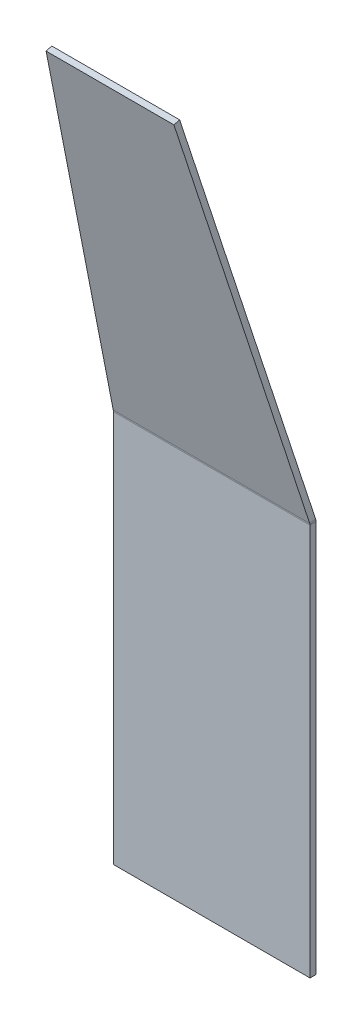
ISO-10303-21;
HEADER;
FILE_DESCRIPTION(('STEP AP214'),'2;1');
FILE_NAME('part.step','',(''),(''),'','','');
FILE_SCHEMA(('AUTOMOTIVE_DESIGN { 1 0 10303 214 1 1 1 1 }'));
ENDSEC;
DATA;
#1=APPLICATION_CONTEXT('core data for automotive mechanical design processes');
#2=APPLICATION_PROTOCOL_DEFINITION('international standard','automotive_design',2000,#1);
#3=PRODUCT_CONTEXT('',#1,'mechanical');
#4=PRODUCT('Part','Part','',(#3));
#5=PRODUCT_RELATED_PRODUCT_CATEGORY('part','',(#4));
#6=PRODUCT_DEFINITION_FORMATION('','',#4);
#7=PRODUCT_DEFINITION_CONTEXT('part definition',#1,'design');
#8=PRODUCT_DEFINITION('design','',#6,#7);
#9=PRODUCT_DEFINITION_SHAPE('','',#8);
#10=(LENGTH_UNIT() NAMED_UNIT(*) SI_UNIT(.MILLI.,.METRE.));
#11=(NAMED_UNIT(*) PLANE_ANGLE_UNIT() SI_UNIT($,.RADIAN.));
#12=(NAMED_UNIT(*) SI_UNIT($,.STERADIAN.) SOLID_ANGLE_UNIT());
#13=UNCERTAINTY_MEASURE_WITH_UNIT(LENGTH_MEASURE(1.E-05),#10,'distance_accuracy_value','');
#14=(GEOMETRIC_REPRESENTATION_CONTEXT(3) GLOBAL_UNCERTAINTY_ASSIGNED_CONTEXT((#13)) GLOBAL_UNIT_ASSIGNED_CONTEXT((#10,
#11,#12)) REPRESENTATION_CONTEXT('',''));
#15=CARTESIAN_POINT('',(0.,0.,0.));
#16=DIRECTION('',(0.,0.,1.));
#17=DIRECTION('',(1.,0.,0.));
#18=AXIS2_PLACEMENT_3D('',#15,#16,#17);
#19=CARTESIAN_POINT('',(0.,196.401798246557,27.3567872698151));
#20=DIRECTION('',(0.,0.258819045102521,-0.965925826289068));
#21=DIRECTION('',(-1.,0.,0.));
#22=AXIS2_PLACEMENT_3D('',#19,#20,#21);
#23=PLANE('',#22);
#24=DIRECTION('',(-0.0871557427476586,-0.962250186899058,-0.2578341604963));
#25=VECTOR('',#24,1.);
#26=CARTESIAN_POINT('',(0.,99.8092156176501,1.47488275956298));
#27=LINE('',#26,#25);
#28=CARTESIAN_POINT('',(8.74886635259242,196.401798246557,27.3567872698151));
#29=VERTEX_POINT('',#28);
#30=CARTESIAN_POINT('',(0.0257675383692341,100.093704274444,1.5511111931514));
#31=VERTEX_POINT('',#30);
#32=EDGE_CURVE('E112',#29,#31,#27,.T.);
#33=ORIENTED_EDGE('',*,*,#32,.T.);
#34=DIRECTION('',(1.,0.,0.));
#35=VECTOR('',#34,1.);
#36=CARTESIAN_POINT('',(0.,100.09370425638,1.5511112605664));
#37=LINE('',#36,#35);
#38=CARTESIAN_POINT('',(49.9742324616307,100.09370425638,1.5511112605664));
#39=VERTEX_POINT('',#38);
#40=EDGE_CURVE('E152',#31,#39,#37,.T.);
#41=ORIENTED_EDGE('',*,*,#40,.T.);
#42=DIRECTION('',(-0.0871557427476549,0.962250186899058,0.2578341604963));
#43=VECTOR('',#42,1.);
#44=CARTESIAN_POINT('',(41.2511336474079,196.401798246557,27.3567872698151));
#45=LINE('',#44,#43);
#46=CARTESIAN_POINT('',(41.2511336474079,196.401798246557,27.3567872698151));
#47=VERTEX_POINT('',#46);
#48=EDGE_CURVE('E116',#39,#47,#45,.T.);
#49=ORIENTED_EDGE('',*,*,#48,.T.);
#50=DIRECTION('',(-1.,0.,0.));
#51=VECTOR('',#50,1.);
#52=CARTESIAN_POINT('',(8.74886635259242,196.401798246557,27.3567872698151));
#53=LINE('',#52,#51);
#54=EDGE_CURVE('E80',#47,#29,#53,.T.);
#55=ORIENTED_EDGE('',*,*,#54,.T.);
#56=EDGE_LOOP('',(#33,#41,#49,#55));
#57=FACE_BOUND('',#56,.T.);
#58=ADVANCED_FACE('F52',(#57),#23,.F.);
#59=CARTESIAN_POINT('',(0.,99.8092156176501,1.47488275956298));
#60=DIRECTION('',(0.996194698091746,-0.0841859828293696,-0.02255756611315));
#61=DIRECTION('',(0.0871557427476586,0.962250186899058,0.2578341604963));
#62=AXIS2_PLACEMENT_3D('',#59,#60,#61);
#63=PLANE('',#62);
#64=DIRECTION('',(-0.0871557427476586,-0.962250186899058,-0.2578341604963));
#65=VECTOR('',#64,1.);
#66=CARTESIAN_POINT('',(0.,100.197444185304,0.0259940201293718));
#67=LINE('',#66,#65);
#68=CARTESIAN_POINT('',(8.74886635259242,196.790026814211,25.9078985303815));
#69=VERTEX_POINT('',#68);
#70=CARTESIAN_POINT('',(0.0257675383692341,100.481932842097,0.102222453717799));
#71=VERTEX_POINT('',#70);
#72=EDGE_CURVE('E103',#69,#71,#67,.T.);
#73=ORIENTED_EDGE('',*,*,#72,.T.);
#74=CARTESIAN_POINT('',(0.0257675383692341,100.093704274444,1.5511111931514));
#75=CARTESIAN_POINT('',(0.0257675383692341,100.481932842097,0.1022224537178));
#76=B_SPLINE_CURVE_WITH_KNOTS('',1,(#74,#75),.UNSPECIFIED.,.F.,.F.,(2,2),(0.,1.),.UNSPECIFIED.);
#77=EDGE_CURVE('E128',#71,#31,#76,.F.);
#78=ORIENTED_EDGE('',*,*,#77,.T.);
#79=ORIENTED_EDGE('',*,*,#32,.F.);
#80=DIRECTION('',(0.,0.258819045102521,-0.965925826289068));
#81=VECTOR('',#80,1.);
#82=CARTESIAN_POINT('',(8.74886635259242,196.401798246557,27.3567872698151));
#83=LINE('',#82,#81);
#84=EDGE_CURVE('E96',#29,#69,#83,.T.);
#85=ORIENTED_EDGE('',*,*,#84,.T.);
#86=EDGE_LOOP('',(#73,#78,#79,#85));
#87=FACE_BOUND('',#86,.T.);
#88=ADVANCED_FACE('F108',(#87),#63,.F.);
#89=CARTESIAN_POINT('',(41.2511336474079,196.401798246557,27.3567872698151));
#90=DIRECTION('',(-0.996194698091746,-0.084185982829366,-0.022557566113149));
#91=DIRECTION('',(0.0871557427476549,-0.962250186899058,-0.2578341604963));
#92=AXIS2_PLACEMENT_3D('',#89,#90,#91);
#93=PLANE('',#92);
#94=ORIENTED_EDGE('',*,*,#48,.F.);
#95=CARTESIAN_POINT('',(49.9742324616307,100.481932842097,0.1022224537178));
#96=CARTESIAN_POINT('',(49.9742324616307,100.093704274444,1.5511111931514));
#97=B_SPLINE_CURVE_WITH_KNOTS('',1,(#95,#96),.UNSPECIFIED.,.F.,.F.,(2,2),(0.,1.),.UNSPECIFIED.);
#98=CARTESIAN_POINT('',(49.9742324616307,100.481932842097,0.102222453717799));
#99=VERTEX_POINT('',#98);
#100=EDGE_CURVE('E12',#39,#99,#97,.F.);
#101=ORIENTED_EDGE('',*,*,#100,.T.);
#102=DIRECTION('',(-0.0871557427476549,0.962250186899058,0.2578341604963));
#103=VECTOR('',#102,1.);
#104=CARTESIAN_POINT('',(41.2511336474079,196.790026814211,25.9078985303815));
#105=LINE('',#104,#103);
#106=CARTESIAN_POINT('',(41.2511336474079,196.790026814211,25.9078985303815));
#107=VERTEX_POINT('',#106);
#108=EDGE_CURVE('E104',#99,#107,#105,.T.);
#109=ORIENTED_EDGE('',*,*,#108,.T.);
#110=DIRECTION('',(0.,0.258819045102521,-0.965925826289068));
#111=VECTOR('',#110,1.);
#112=CARTESIAN_POINT('',(41.2511336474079,196.401798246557,27.3567872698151));
#113=LINE('',#112,#111);
#114=EDGE_CURVE('E99',#47,#107,#113,.T.);
#115=ORIENTED_EDGE('',*,*,#114,.F.);
#116=EDGE_LOOP('',(#94,#101,#109,#115));
#117=FACE_BOUND('',#116,.T.);
#118=ADVANCED_FACE('F54',(#117),#93,.F.);
#119=CARTESIAN_POINT('',(8.74886635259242,196.401798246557,27.3567872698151));
#120=DIRECTION('',(0.,-0.965925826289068,-0.258819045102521));
#121=DIRECTION('',(0.,0.258819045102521,-0.965925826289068));
#122=AXIS2_PLACEMENT_3D('',#119,#120,#121);
#123=PLANE('',#122);
#124=DIRECTION('',(-1.,0.,0.));
#125=VECTOR('',#124,1.);
#126=CARTESIAN_POINT('',(8.74886635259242,196.790026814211,25.9078985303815));
#127=LINE('',#126,#125);
#128=EDGE_CURVE('E93',#107,#69,#127,.T.);
#129=ORIENTED_EDGE('',*,*,#128,.T.);
#130=ORIENTED_EDGE('',*,*,#84,.F.);
#131=ORIENTED_EDGE('',*,*,#54,.F.);
#132=ORIENTED_EDGE('',*,*,#114,.T.);
#133=EDGE_LOOP('',(#129,#130,#131,#132));
#134=FACE_BOUND('',#133,.T.);
#135=ADVANCED_FACE('F95',(#134),#123,.F.);
#136=CARTESIAN_POINT('',(0.,196.790026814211,25.9078985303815));
#137=DIRECTION('',(0.,0.258819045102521,-0.965925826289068));
#138=DIRECTION('',(-1.,0.,0.));
#139=AXIS2_PLACEMENT_3D('',#136,#137,#138);
#140=PLANE('',#139);
#141=DIRECTION('',(1.,0.,0.));
#142=VECTOR('',#141,1.);
#143=CARTESIAN_POINT('',(0.,100.481932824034,0.102222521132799));
#144=LINE('',#143,#142);
#145=EDGE_CURVE('E63',#71,#99,#144,.T.);
#146=ORIENTED_EDGE('',*,*,#145,.F.);
#147=ORIENTED_EDGE('',*,*,#72,.F.);
#148=ORIENTED_EDGE('',*,*,#128,.F.);
#149=ORIENTED_EDGE('',*,*,#108,.F.);
#150=EDGE_LOOP('',(#146,#147,#148,#149));
#151=FACE_BOUND('',#150,.T.);
#152=ADVANCED_FACE('F114',(#151),#140,.T.);
#153=CARTESIAN_POINT('',(0.,0.,1.5));
#154=DIRECTION('',(0.,1.,0.));
#155=DIRECTION('',(0.,0.,1.));
#156=AXIS2_PLACEMENT_3D('',#153,#154,#155);
#157=PLANE('',#156);
#158=DIRECTION('',(1.,0.,0.));
#159=VECTOR('',#158,1.);
#160=CARTESIAN_POINT('',(0.,0.,0.));
#161=LINE('',#160,#159);
#162=CARTESIAN_POINT('',(0.,0.,0.));
#163=VERTEX_POINT('',#162);
#164=CARTESIAN_POINT('',(50.,0.,0.));
#165=VERTEX_POINT('',#164);
#166=EDGE_CURVE('E296',#163,#165,#161,.T.);
#167=ORIENTED_EDGE('',*,*,#166,.T.);
#168=DIRECTION('',(0.,0.,-1.));
#169=VECTOR('',#168,1.);
#170=CARTESIAN_POINT('',(50.,0.,1.5));
#171=LINE('',#170,#169);
#172=CARTESIAN_POINT('',(50.,0.,1.5));
#173=VERTEX_POINT('',#172);
#174=EDGE_CURVE('E317',#173,#165,#171,.T.);
#175=ORIENTED_EDGE('',*,*,#174,.F.);
#176=DIRECTION('',(1.,0.,0.));
#177=VECTOR('',#176,1.);
#178=CARTESIAN_POINT('',(0.,0.,1.5));
#179=LINE('',#178,#177);
#180=CARTESIAN_POINT('',(0.,0.,1.5));
#181=VERTEX_POINT('',#180);
#182=EDGE_CURVE('E305',#181,#173,#179,.T.);
#183=ORIENTED_EDGE('',*,*,#182,.F.);
#184=DIRECTION('',(0.,0.,-1.));
#185=VECTOR('',#184,1.);
#186=CARTESIAN_POINT('',(0.,0.,1.5));
#187=LINE('',#186,#185);
#188=EDGE_CURVE('E299',#181,#163,#187,.T.);
#189=ORIENTED_EDGE('',*,*,#188,.T.);
#190=EDGE_LOOP('',(#167,#175,#183,#189));
#191=FACE_BOUND('',#190,.T.);
#192=ADVANCED_FACE('F337',(#191),#157,.F.);
#193=CARTESIAN_POINT('',(0.,200.,1.5));
#194=DIRECTION('',(0.,0.,-1.));
#195=DIRECTION('',(-1.,0.,0.));
#196=AXIS2_PLACEMENT_3D('',#193,#194,#195);
#197=PLANE('',#196);
#198=DIRECTION('',(1.,0.,0.));
#199=VECTOR('',#198,1.);
#200=CARTESIAN_POINT('',(0.,99.705475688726,1.5));
#201=LINE('',#200,#199);
#202=CARTESIAN_POINT('',(1.10630273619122E-13,99.705475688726,1.49999993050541));
#203=VERTEX_POINT('',#202);
#204=CARTESIAN_POINT('',(50.,99.705475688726,1.5));
#205=VERTEX_POINT('',#204);
#206=EDGE_CURVE('E283',#203,#205,#201,.T.);
#207=ORIENTED_EDGE('',*,*,#206,.F.);
#208=DIRECTION('',(0.,-1.,0.));
#209=VECTOR('',#208,1.);
#210=CARTESIAN_POINT('',(0.,0.,1.5));
#211=LINE('',#210,#209);
#212=EDGE_CURVE('E302',#203,#181,#211,.T.);
#213=ORIENTED_EDGE('',*,*,#212,.T.);
#214=ORIENTED_EDGE('',*,*,#182,.T.);
#215=DIRECTION('',(0.,1.,0.));
#216=VECTOR('',#215,1.);
#217=CARTESIAN_POINT('',(50.,0.,1.5));
#218=LINE('',#217,#216);
#219=EDGE_CURVE('E308',#173,#205,#218,.T.);
#220=ORIENTED_EDGE('',*,*,#219,.T.);
#221=EDGE_LOOP('',(#207,#213,#214,#220));
#222=FACE_BOUND('',#221,.T.);
#223=ADVANCED_FACE('F386',(#222),#197,.F.);
#224=CARTESIAN_POINT('',(0.,0.,1.5));
#225=DIRECTION('',(1.,0.,0.));
#226=DIRECTION('',(0.,1.,0.));
#227=AXIS2_PLACEMENT_3D('',#224,#225,#226);
#228=PLANE('',#227);
#229=DIRECTION('',(0.,0.,1.));
#230=VECTOR('',#229,1.);
#231=CARTESIAN_POINT('',(0.,99.705475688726,1.5000000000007));
#232=LINE('',#231,#230);
#233=CARTESIAN_POINT('',(0.,99.705475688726,0.));
#234=VERTEX_POINT('',#233);
#235=EDGE_CURVE('E290',#234,#203,#232,.T.);
#236=ORIENTED_EDGE('',*,*,#235,.F.);
#237=DIRECTION('',(0.,-1.,0.));
#238=VECTOR('',#237,1.);
#239=CARTESIAN_POINT('',(0.,0.,0.));
#240=LINE('',#239,#238);
#241=EDGE_CURVE('E311',#234,#163,#240,.T.);
#242=ORIENTED_EDGE('',*,*,#241,.T.);
#243=ORIENTED_EDGE('',*,*,#188,.F.);
#244=ORIENTED_EDGE('',*,*,#212,.F.);
#245=EDGE_LOOP('',(#236,#242,#243,#244));
#246=FACE_BOUND('',#245,.T.);
#247=ADVANCED_FACE('F401',(#246),#228,.F.);
#248=CARTESIAN_POINT('',(0.,200.,0.));
#249=DIRECTION('',(0.,0.,-1.));
#250=DIRECTION('',(-1.,0.,0.));
#251=AXIS2_PLACEMENT_3D('',#248,#249,#250);
#252=PLANE('',#251);
#253=ORIENTED_EDGE('',*,*,#241,.F.);
#254=DIRECTION('',(1.,0.,0.));
#255=VECTOR('',#254,1.);
#256=CARTESIAN_POINT('',(0.,99.705475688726,0.));
#257=LINE('',#256,#255);
#258=CARTESIAN_POINT('',(50.,99.705475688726,0.));
#259=VERTEX_POINT('',#258);
#260=EDGE_CURVE('E314',#234,#259,#257,.T.);
#261=ORIENTED_EDGE('',*,*,#260,.T.);
#262=DIRECTION('',(0.,1.,0.));
#263=VECTOR('',#262,1.);
#264=CARTESIAN_POINT('',(50.,0.,0.));
#265=LINE('',#264,#263);
#266=EDGE_CURVE('E132',#165,#259,#265,.T.);
#267=ORIENTED_EDGE('',*,*,#266,.F.);
#268=ORIENTED_EDGE('',*,*,#166,.F.);
#269=EDGE_LOOP('',(#253,#261,#267,#268));
#270=FACE_BOUND('',#269,.T.);
#271=ADVANCED_FACE('F395',(#270),#252,.T.);
#272=CARTESIAN_POINT('',(50.,0.,1.5));
#273=DIRECTION('',(-1.,0.,0.));
#274=DIRECTION('',(0.,-1.,0.));
#275=AXIS2_PLACEMENT_3D('',#272,#273,#274);
#276=PLANE('',#275);
#277=DIRECTION('',(0.,0.,-1.));
#278=VECTOR('',#277,1.);
#279=CARTESIAN_POINT('',(50.,99.705475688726,1.5000000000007));
#280=LINE('',#279,#278);
#281=EDGE_CURVE('E286',#205,#259,#280,.T.);
#282=ORIENTED_EDGE('',*,*,#281,.F.);
#283=ORIENTED_EDGE('',*,*,#219,.F.);
#284=ORIENTED_EDGE('',*,*,#174,.T.);
#285=ORIENTED_EDGE('',*,*,#266,.T.);
#286=EDGE_LOOP('',(#282,#283,#284,#285));
#287=FACE_BOUND('',#286,.T.);
#288=ADVANCED_FACE('F390',(#287),#276,.F.);
#289=CARTESIAN_POINT('',(0.,99.705475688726,3.00000006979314));
#290=DIRECTION('',(1.,7.00763223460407E-13,0.));
#291=DIRECTION('',(-7.00763223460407E-13,1.,0.));
#292=AXIS2_PLACEMENT_3D('',#289,#290,#291);
#293=PLANE('',#292);
#294=CARTESIAN_POINT('',(0.,100.097054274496,0.0256653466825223));
#295=CARTESIAN_POINT('',(0.,99.9012649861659,1.51283263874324));
#296=B_SPLINE_CURVE_WITH_KNOTS('',1,(#294,#295),.UNSPECIFIED.,.F.,.F.,(2,2),(0.,1.),.UNSPECIFIED.);
#297=CARTESIAN_POINT('',(0.,100.097054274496,0.025665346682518));
#298=VERTEX_POINT('',#297);
#299=CARTESIAN_POINT('',(0.,99.9012649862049,1.51283263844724));
#300=VERTEX_POINT('',#299);
#301=EDGE_CURVE('E280',#298,#300,#296,.T.);
#302=ORIENTED_EDGE('',*,*,#301,.F.);
#303=CARTESIAN_POINT('',(0.,99.705475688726,3.));
#304=DIRECTION('',(-1.,0.,0.));
#305=DIRECTION('',(0.,0.,1.));
#306=AXIS2_PLACEMENT_3D('',#303,#304,#305);
#307=CIRCLE('',#306,3.00000006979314);
#308=EDGE_CURVE('E189',#298,#234,#307,.T.);
#309=ORIENTED_EDGE('',*,*,#308,.T.);
#310=ORIENTED_EDGE('',*,*,#235,.T.);
#311=CARTESIAN_POINT('',(0.,99.705475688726,3.00000006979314));
#312=DIRECTION('',(-1.,-7.00763223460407E-13,0.));
#313=DIRECTION('',(7.00763223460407E-13,-1.,0.));
#314=AXIS2_PLACEMENT_3D('',#311,#312,#313);
#315=CIRCLE('',#314,1.50000013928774);
#316=EDGE_CURVE('E190',#300,#203,#315,.T.);
#317=ORIENTED_EDGE('',*,*,#316,.F.);
#318=EDGE_LOOP('',(#302,#309,#310,#317));
#319=FACE_BOUND('',#318,.T.);
#320=ADVANCED_FACE('F335',(#319),#293,.F.);
#321=CARTESIAN_POINT('',(50.,99.705475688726,3.00000006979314));
#322=DIRECTION('',(-1.,0.,0.));
#323=DIRECTION('',(0.,0.,1.));
#324=AXIS2_PLACEMENT_3D('',#321,#322,#323);
#325=PLANE('',#324);
#326=ORIENTED_EDGE('',*,*,#281,.T.);
#327=CARTESIAN_POINT('',(50.,99.705475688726,3.));
#328=DIRECTION('',(-1.,0.,0.));
#329=DIRECTION('',(0.,0.,1.));
#330=AXIS2_PLACEMENT_3D('',#327,#328,#329);
#331=CIRCLE('',#330,3.00000006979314);
#332=CARTESIAN_POINT('',(50.,100.097054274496,0.025665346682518));
#333=VERTEX_POINT('',#332);
#334=EDGE_CURVE('E220',#259,#333,#331,.F.);
#335=ORIENTED_EDGE('',*,*,#334,.T.);
#336=CARTESIAN_POINT('',(50.,99.9012649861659,1.51283263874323));
#337=CARTESIAN_POINT('',(50.,100.097054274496,0.0256653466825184));
#338=B_SPLINE_CURVE_WITH_KNOTS('',1,(#336,#337),.UNSPECIFIED.,.F.,.F.,(2,2),(0.,1.),.UNSPECIFIED.);
#339=CARTESIAN_POINT('',(50.,99.9012649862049,1.51283263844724));
#340=VERTEX_POINT('',#339);
#341=EDGE_CURVE('E277',#333,#340,#338,.F.);
#342=ORIENTED_EDGE('',*,*,#341,.T.);
#343=CARTESIAN_POINT('',(50.,99.705475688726,3.00000006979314));
#344=DIRECTION('',(1.,0.,0.));
#345=DIRECTION('',(0.,0.,-1.));
#346=AXIS2_PLACEMENT_3D('',#343,#344,#345);
#347=CIRCLE('',#346,1.50000013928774);
#348=EDGE_CURVE('E251',#205,#340,#347,.T.);
#349=ORIENTED_EDGE('',*,*,#348,.F.);
#350=EDGE_LOOP('',(#326,#335,#342,#349));
#351=FACE_BOUND('',#350,.T.);
#352=ADVANCED_FACE('F393',(#351),#325,.F.);
#353=CARTESIAN_POINT('',(50.,100.097054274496,0.0256653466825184));
#354=CARTESIAN_POINT('',(49.9914107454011,100.226835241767,0.0427513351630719));
#355=CARTESIAN_POINT('',(49.9828217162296,100.355492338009,0.0683428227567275));
#356=CARTESIAN_POINT('',(49.9742324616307,100.481932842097,0.1022224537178));
#357=CARTESIAN_POINT('',(50.,99.9012649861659,1.51283263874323));
#358=CARTESIAN_POINT('',(49.9914107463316,99.9661554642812,1.52137563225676));
#359=CARTESIAN_POINT('',(49.9828217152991,100.030484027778,1.53417137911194));
#360=CARTESIAN_POINT('',(49.9742324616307,100.093704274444,1.5511111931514));
#361=B_SPLINE_SURFACE_WITH_KNOTS('',1,3,((#353,#354,#355,#356),(#357,#358,#359,#360)),
.UNSPECIFIED.,.F.,.F.,.F.,(2,2),(4,4),(0.,1.),(0.,1.),.UNSPECIFIED.);
#362=CARTESIAN_POINT('',(50.,100.097054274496,0.0256653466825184));
#363=CARTESIAN_POINT('',(49.9914107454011,100.226835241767,0.0427513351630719));
#364=CARTESIAN_POINT('',(49.9828217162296,100.355492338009,0.0683428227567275));
#365=CARTESIAN_POINT('',(49.9742324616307,100.481932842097,0.1022224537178));
#366=B_SPLINE_CURVE_WITH_KNOTS('',3,(#362,#363,#364,#365),.UNSPECIFIED.,.F.,.F.,(4,4),(0.,1.),.UNSPECIFIED.);
#367=EDGE_CURVE('E148',#333,#99,#366,.T.);
#368=CARTESIAN_POINT('',(49.9742324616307,100.093704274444,1.5511111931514));
#369=CARTESIAN_POINT('',(49.9828217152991,100.030484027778,1.53417137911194));
#370=CARTESIAN_POINT('',(49.9914107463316,99.9661554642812,1.52137563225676));
#371=CARTESIAN_POINT('',(50.,99.9012649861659,1.51283263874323));
#372=B_SPLINE_CURVE_WITH_KNOTS('',3,(#368,#369,#370,#371),.UNSPECIFIED.,.F.,.F.,(4,4),(0.,1.),.UNSPECIFIED.);
#373=EDGE_CURVE('E70',#340,#39,#372,.F.);
#374=ORIENTED_EDGE('',*,*,#341,.F.);
#375=ORIENTED_EDGE('',*,*,#367,.T.);
#376=ORIENTED_EDGE('',*,*,#100,.F.);
#377=ORIENTED_EDGE('',*,*,#373,.F.);
#378=EDGE_LOOP('',(#374,#375,#376,#377));
#379=FACE_BOUND('',#378,.T.);
#380=ADVANCED_FACE('F144',(#379),#361,.F.);
#381=CARTESIAN_POINT('',(0.0257675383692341,100.481932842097,0.1022224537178));
#382=CARTESIAN_POINT('',(0.0171782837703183,100.355492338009,0.0683428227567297));
#383=CARTESIAN_POINT('',(0.00858925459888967,100.226835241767,0.0427513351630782));
#384=CARTESIAN_POINT('',(0.,100.097054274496,0.0256653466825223));
#385=CARTESIAN_POINT('',(0.0257675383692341,100.093704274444,1.5511111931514));
#386=CARTESIAN_POINT('',(0.0171782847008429,100.030484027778,1.53417137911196));
#387=CARTESIAN_POINT('',(0.00858925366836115,99.9661554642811,1.52137563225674));
#388=CARTESIAN_POINT('',(0.,99.9012649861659,1.51283263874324));
#389=B_SPLINE_SURFACE_WITH_KNOTS('',1,3,((#381,#382,#383,#384),(#385,#386,#387,#388)),
.UNSPECIFIED.,.F.,.F.,.F.,(2,2),(4,4),(0.,1.),(0.,1.),.UNSPECIFIED.);
#390=CARTESIAN_POINT('',(0.0257675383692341,100.481932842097,0.1022224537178));
#391=CARTESIAN_POINT('',(0.0171782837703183,100.355492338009,0.0683428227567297));
#392=CARTESIAN_POINT('',(0.00858925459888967,100.226835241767,0.0427513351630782));
#393=CARTESIAN_POINT('',(0.,100.097054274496,0.0256653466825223));
#394=B_SPLINE_CURVE_WITH_KNOTS('',3,(#390,#391,#392,#393),.UNSPECIFIED.,.F.,.F.,(4,4),(0.,1.),.UNSPECIFIED.);
#395=EDGE_CURVE('E175',#71,#298,#394,.T.);
#396=CARTESIAN_POINT('',(0.,99.9012649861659,1.51283263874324));
#397=CARTESIAN_POINT('',(0.00858925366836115,99.9661554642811,1.52137563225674));
#398=CARTESIAN_POINT('',(0.0171782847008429,100.030484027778,1.53417137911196));
#399=CARTESIAN_POINT('',(0.0257675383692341,100.093704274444,1.5511111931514));
#400=B_SPLINE_CURVE_WITH_KNOTS('',3,(#396,#397,#398,#399),.UNSPECIFIED.,.F.,.F.,(4,4),(0.,1.),.UNSPECIFIED.);
#401=EDGE_CURVE('E177',#31,#300,#400,.F.);
#402=ORIENTED_EDGE('',*,*,#395,.T.);
#403=ORIENTED_EDGE('',*,*,#301,.T.);
#404=ORIENTED_EDGE('',*,*,#401,.F.);
#405=ORIENTED_EDGE('',*,*,#77,.F.);
#406=EDGE_LOOP('',(#402,#403,#404,#405));
#407=FACE_BOUND('',#406,.T.);
#408=ADVANCED_FACE('F172',(#407),#389,.F.);
#409=CARTESIAN_POINT('',(75.0259630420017,99.705475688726,3.));
#410=DIRECTION('',(-1.,0.,0.));
#411=DIRECTION('',(0.,0.,1.));
#412=AXIS2_PLACEMENT_3D('',#409,#410,#411);
#413=CYLINDRICAL_SURFACE('',#412,1.50000006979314);
#414=ORIENTED_EDGE('',*,*,#40,.F.);
#415=ORIENTED_EDGE('',*,*,#401,.T.);
#416=ORIENTED_EDGE('',*,*,#316,.T.);
#417=ORIENTED_EDGE('',*,*,#206,.T.);
#418=ORIENTED_EDGE('',*,*,#348,.T.);
#419=ORIENTED_EDGE('',*,*,#373,.T.);
#420=EDGE_LOOP('',(#414,#415,#416,#417,#418,#419));
#421=FACE_BOUND('',#420,.T.);
#422=ADVANCED_FACE('F207',(#421),#413,.F.);
#423=CARTESIAN_POINT('',(75.0259630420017,99.705475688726,3.));
#424=DIRECTION('',(-1.,0.,0.));
#425=DIRECTION('',(0.,0.,1.));
#426=AXIS2_PLACEMENT_3D('',#423,#424,#425);
#427=CYLINDRICAL_SURFACE('',#426,3.00000006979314);
#428=ORIENTED_EDGE('',*,*,#145,.T.);
#429=ORIENTED_EDGE('',*,*,#367,.F.);
#430=ORIENTED_EDGE('',*,*,#334,.F.);
#431=ORIENTED_EDGE('',*,*,#260,.F.);
#432=ORIENTED_EDGE('',*,*,#308,.F.);
#433=ORIENTED_EDGE('',*,*,#395,.F.);
#434=EDGE_LOOP('',(#428,#429,#430,#431,#432,#433));
#435=FACE_BOUND('',#434,.T.);
#436=ADVANCED_FACE('F186',(#435),#427,.T.);
#437=CLOSED_SHELL('',(#58,#88,#118,#135,#152,#192,#223,#247,#271,#288,#320,#352,#380,#408,#422,#436));
#438=MANIFOLD_SOLID_BREP('B2',#437);
#439=ADVANCED_BREP_SHAPE_REPRESENTATION('',(#18,#438),#14);
#440=SHAPE_DEFINITION_REPRESENTATION(#9,#439);
ENDSEC;
END-ISO-10303-21;
